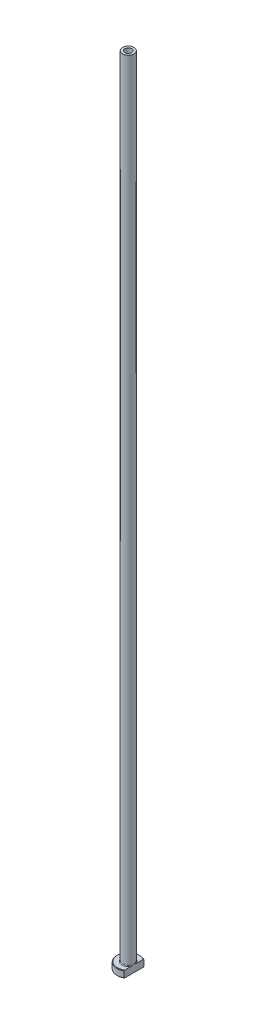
from build123d import *

# Parameters (mm, degrees)
FILLET1_R          = 0.3
CHAMFER1_SIZE      = 0.2
CUT_EXTRUDE1_DEPTH = 351.071421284
CHAMFER2_SIZE      = 0.5


with BuildPart() as part:
    # Sketch1 → Revolve1 (revolve)
    with BuildSketch(Plane.XY, mode=Mode.PRIVATE) as revolve1_sk:
        Polygon((-1.5, 350), (-2.5, 350), (-2.5, 3), (-5, 3), (-5, 0), (-1.75, 0), (-1.75, 293), (-1.5, 305), align=None)
    revolve(revolve1_sk.sketch.rotate(Axis((0, 92.187680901, 0), (0, -1, 0)), 270), axis=Axis((0, 92.187680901, 0), (0, -1, 0)))

    # Fillet1
    fillet1_edges = [part.edges().sort_by_distance(p)[0] for p in [
        (0, 3, -2.5),
    ]]
    fillet(fillet1_edges, radius=FILLET1_R)

    # Chamfer1
    chamfer1_edges = [part.edges().sort_by_distance(p)[0] for p in [
        (0, 0, -5),
        (0, 3, -5),
    ]]
    chamfer(chamfer1_edges, length=CHAMFER1_SIZE)

    # Sketch2 → Cut-Extrude1 (cut, through all)
    with BuildSketch(Plane.XZ):
        with BuildLine():
            Line((2.5, 4.330127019), (2.5, -4.330127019))
            ThreePointArc((2.5, -4.330127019), (5, 0), (2.5, 4.330127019))
        make_face()
    extrude(amount=-CUT_EXTRUDE1_DEPTH, mode=Mode.SUBTRACT)

    # Chamfer2
    chamfer2_edges = [part.edges().sort_by_distance(p)[0] for p in [
        (0, 0, -1.75),
    ]]
    chamfer(chamfer2_edges, length=CHAMFER2_SIZE)


solid = part.part
